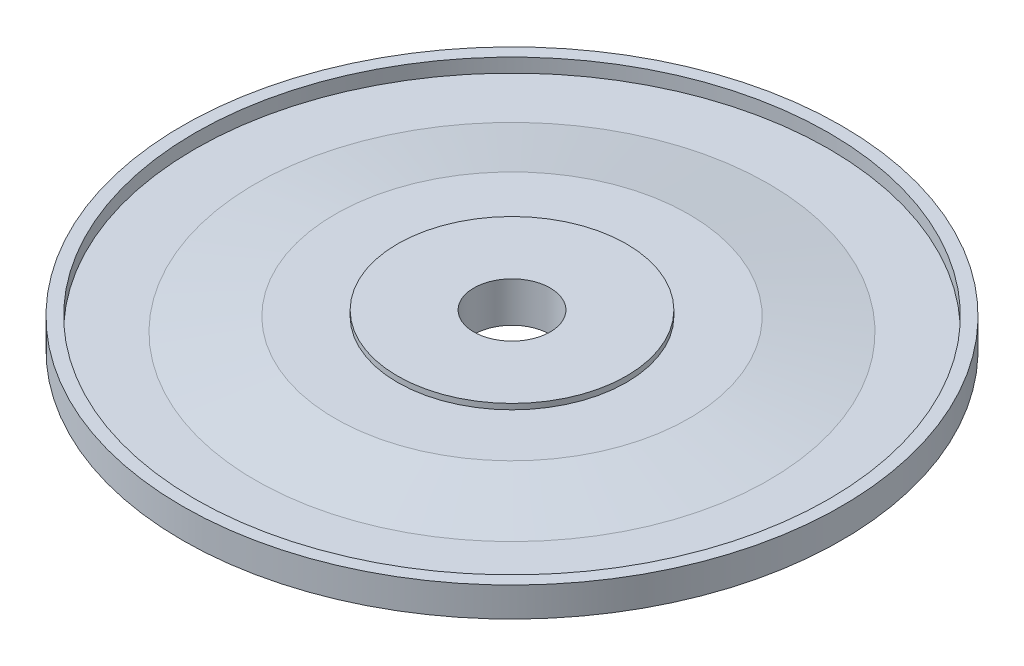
from build123d import *


with BuildPart() as part:
    # Esquisse1 → R_volution1 (revolve)
    with BuildSketch(Plane.XY, mode=Mode.PRIVATE) as r_volution1_sk:
        Polygon((16.5, 0), (47.5, 0), (47.5, 4.25), (45.7, 4.25), (45.7, 2.25), (37, 2.25), (25.5, 4.2), (16.5, 4.2), (16.5, 5), (5.5, 5), (5.5, -0.8), (16.5, -0.8), align=None)
    revolve(r_volution1_sk.sketch.rotate(Axis((0, 0, 0), (0, 1, 0)), 90), axis=Axis((0, 0, 0), (0, 1, 0)))


solid = part.part
